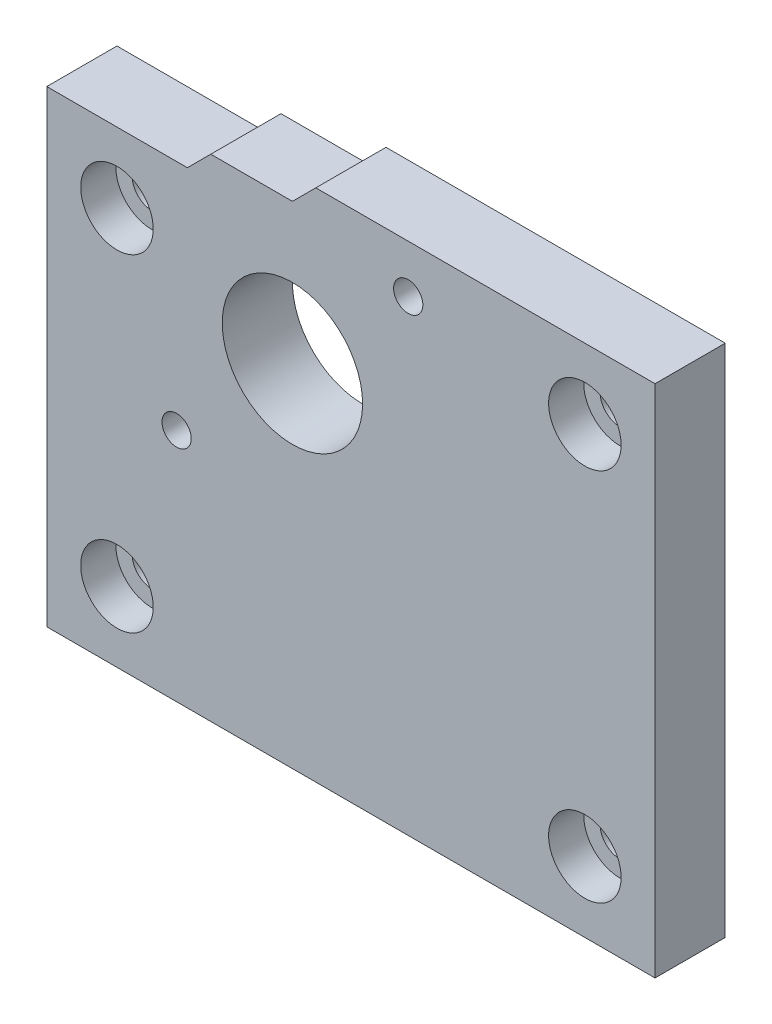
ISO-10303-21;
HEADER;
FILE_DESCRIPTION(('STEP AP214'),'2;1');
FILE_NAME('part.step','',(''),(''),'','','');
FILE_SCHEMA(('AUTOMOTIVE_DESIGN { 1 0 10303 214 1 1 1 1 }'));
ENDSEC;
DATA;
#1=APPLICATION_CONTEXT('core data for automotive mechanical design processes');
#2=APPLICATION_PROTOCOL_DEFINITION('international standard','automotive_design',2000,#1);
#3=PRODUCT_CONTEXT('',#1,'mechanical');
#4=PRODUCT('Part','Part','',(#3));
#5=PRODUCT_RELATED_PRODUCT_CATEGORY('part','',(#4));
#6=PRODUCT_DEFINITION_FORMATION('','',#4);
#7=PRODUCT_DEFINITION_CONTEXT('part definition',#1,'design');
#8=PRODUCT_DEFINITION('design','',#6,#7);
#9=PRODUCT_DEFINITION_SHAPE('','',#8);
#10=(LENGTH_UNIT() NAMED_UNIT(*) SI_UNIT(.MILLI.,.METRE.));
#11=(NAMED_UNIT(*) PLANE_ANGLE_UNIT() SI_UNIT($,.RADIAN.));
#12=(NAMED_UNIT(*) SI_UNIT($,.STERADIAN.) SOLID_ANGLE_UNIT());
#13=UNCERTAINTY_MEASURE_WITH_UNIT(LENGTH_MEASURE(1.E-05),#10,'distance_accuracy_value','');
#14=(GEOMETRIC_REPRESENTATION_CONTEXT(3) GLOBAL_UNCERTAINTY_ASSIGNED_CONTEXT((#13)) GLOBAL_UNIT_ASSIGNED_CONTEXT((#10,
#11,#12)) REPRESENTATION_CONTEXT('',''));
#15=CARTESIAN_POINT('',(0.,0.,0.));
#16=DIRECTION('',(0.,0.,1.));
#17=DIRECTION('',(1.,0.,0.));
#18=AXIS2_PLACEMENT_3D('',#15,#16,#17);
#19=CARTESIAN_POINT('',(-41.6094189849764,34.1564907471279,6.));
#20=DIRECTION('',(0.,0.,-1.));
#21=DIRECTION('',(-1.,0.,0.));
#22=AXIS2_PLACEMENT_3D('',#19,#20,#21);
#23=PLANE('',#22);
#24=CARTESIAN_POINT('',(-30.5089139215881,10.2569958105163,6.));
#25=DIRECTION('',(0.,0.,1.));
#26=DIRECTION('',(1.,0.,0.));
#27=AXIS2_PLACEMENT_3D('',#24,#25,#26);
#28=CIRCLE('',#27,1.25);
#29=CARTESIAN_POINT('',(-29.2589139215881,10.2569958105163,6.));
#30=VERTEX_POINT('',#29);
#31=EDGE_CURVE('E592',#30,#30,#28,.T.);
#32=ORIENTED_EDGE('',*,*,#31,.F.);
#33=EDGE_LOOP('',(#32));
#34=FACE_BOUND('',#33,.T.);
#35=CARTESIAN_POINT('',(-20.6094189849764,20.156490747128,6.));
#36=DIRECTION('',(0.,0.,1.));
#37=DIRECTION('',(1.,0.,0.));
#38=AXIS2_PLACEMENT_3D('',#35,#36,#37);
#39=CIRCLE('',#38,6.);
#40=CARTESIAN_POINT('',(-14.6094189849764,20.156490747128,6.));
#41=VERTEX_POINT('',#40);
#42=EDGE_CURVE('E519',#41,#41,#39,.T.);
#43=ORIENTED_EDGE('',*,*,#42,.F.);
#44=EDGE_LOOP('',(#43));
#45=FACE_BOUND('',#44,.T.);
#46=CARTESIAN_POINT('',(-35.6094189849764,24.156490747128,6.));
#47=DIRECTION('',(0.,0.,1.));
#48=DIRECTION('',(1.,0.,0.));
#49=AXIS2_PLACEMENT_3D('',#46,#47,#48);
#50=CIRCLE('',#49,3.1);
#51=CARTESIAN_POINT('',(-32.5094189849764,24.156490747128,6.));
#52=VERTEX_POINT('',#51);
#53=EDGE_CURVE('E531',#52,#52,#50,.T.);
#54=ORIENTED_EDGE('',*,*,#53,.F.);
#55=EDGE_LOOP('',(#54));
#56=FACE_BOUND('',#55,.T.);
#57=CARTESIAN_POINT('',(-35.6094189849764,-3.84350925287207,6.));
#58=DIRECTION('',(0.,0.,1.));
#59=DIRECTION('',(1.,0.,0.));
#60=AXIS2_PLACEMENT_3D('',#57,#58,#59);
#61=CIRCLE('',#60,3.1);
#62=CARTESIAN_POINT('',(-32.5094189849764,-3.84350925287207,6.));
#63=VERTEX_POINT('',#62);
#64=EDGE_CURVE('E543',#63,#63,#61,.T.);
#65=ORIENTED_EDGE('',*,*,#64,.F.);
#66=EDGE_LOOP('',(#65));
#67=FACE_BOUND('',#66,.T.);
#68=DIRECTION('',(1.,0.,0.));
#69=VECTOR('',#68,1.);
#70=CARTESIAN_POINT('',(-20.6094189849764,32.1564907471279,6.));
#71=LINE('',#70,#69);
#72=CARTESIAN_POINT('',(-27.5894189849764,32.1564907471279,6.));
#73=VERTEX_POINT('',#72);
#74=CARTESIAN_POINT('',(-20.6094189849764,32.1564907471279,6.));
#75=VERTEX_POINT('',#74);
#76=EDGE_CURVE('E157',#73,#75,#71,.T.);
#77=ORIENTED_EDGE('',*,*,#76,.F.);
#78=DIRECTION('',(-0.707106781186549,-0.707106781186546,0.));
#79=VECTOR('',#78,1.);
#80=CARTESIAN_POINT('',(-29.5894189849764,30.156490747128,6.));
#81=LINE('',#80,#79);
#82=CARTESIAN_POINT('',(-29.5894189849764,30.156490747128,6.));
#83=VERTEX_POINT('',#82);
#84=EDGE_CURVE('E11',#73,#83,#81,.T.);
#85=ORIENTED_EDGE('',*,*,#84,.T.);
#86=DIRECTION('',(-1.,0.,0.));
#87=VECTOR('',#86,1.);
#88=CARTESIAN_POINT('',(-41.6094189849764,30.156490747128,6.));
#89=LINE('',#88,#87);
#90=CARTESIAN_POINT('',(-41.6094189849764,30.156490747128,6.));
#91=VERTEX_POINT('',#90);
#92=EDGE_CURVE('E164',#83,#91,#89,.T.);
#93=ORIENTED_EDGE('',*,*,#92,.T.);
#94=DIRECTION('',(0.,-1.,0.));
#95=VECTOR('',#94,1.);
#96=CARTESIAN_POINT('',(-41.6094189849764,-9.84350925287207,6.));
#97=LINE('',#96,#95);
#98=CARTESIAN_POINT('',(-41.6094189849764,-9.84350925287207,6.));
#99=VERTEX_POINT('',#98);
#100=EDGE_CURVE('E167',#91,#99,#97,.T.);
#101=ORIENTED_EDGE('',*,*,#100,.T.);
#102=DIRECTION('',(1.,0.,0.));
#103=VECTOR('',#102,1.);
#104=CARTESIAN_POINT('',(-41.6094189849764,-9.84350925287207,6.));
#105=LINE('',#104,#103);
#106=CARTESIAN_POINT('',(10.3905810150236,-9.84350925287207,6.));
#107=VERTEX_POINT('',#106);
#108=EDGE_CURVE('E169',#99,#107,#105,.T.);
#109=ORIENTED_EDGE('',*,*,#108,.T.);
#110=DIRECTION('',(0.,1.,0.));
#111=VECTOR('',#110,1.);
#112=CARTESIAN_POINT('',(10.3905810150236,-9.84350925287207,6.));
#113=LINE('',#112,#111);
#114=CARTESIAN_POINT('',(10.3905810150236,34.1564907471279,6.));
#115=VERTEX_POINT('',#114);
#116=EDGE_CURVE('E172',#107,#115,#113,.T.);
#117=ORIENTED_EDGE('',*,*,#116,.T.);
#118=DIRECTION('',(-1.,0.,0.));
#119=VECTOR('',#118,1.);
#120=CARTESIAN_POINT('',(-41.6094189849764,34.1564907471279,6.));
#121=LINE('',#120,#119);
#122=CARTESIAN_POINT('',(-18.6094189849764,34.1564907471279,6.));
#123=VERTEX_POINT('',#122);
#124=EDGE_CURVE('E174',#115,#123,#121,.T.);
#125=ORIENTED_EDGE('',*,*,#124,.T.);
#126=DIRECTION('',(0.707106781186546,0.707106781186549,0.));
#127=VECTOR('',#126,1.);
#128=CARTESIAN_POINT('',(-18.6094189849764,34.1564907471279,6.));
#129=LINE('',#128,#127);
#130=EDGE_CURVE('E196',#123,#75,#129,.F.);
#131=ORIENTED_EDGE('',*,*,#130,.T.);
#132=EDGE_LOOP('',(#77,#85,#93,#101,#109,#117,#125,#131));
#133=FACE_BOUND('',#132,.T.);
#134=CARTESIAN_POINT('',(4.3905810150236,-3.84350925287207,6.));
#135=DIRECTION('',(0.,0.,1.));
#136=DIRECTION('',(1.,0.,0.));
#137=AXIS2_PLACEMENT_3D('',#134,#135,#136);
#138=CIRCLE('',#137,3.1);
#139=CARTESIAN_POINT('',(7.4905810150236,-3.84350925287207,6.));
#140=VERTEX_POINT('',#139);
#141=EDGE_CURVE('E498',#140,#140,#138,.T.);
#142=ORIENTED_EDGE('',*,*,#141,.F.);
#143=EDGE_LOOP('',(#142));
#144=FACE_BOUND('',#143,.T.);
#145=CARTESIAN_POINT('',(4.3905810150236,28.156490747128,6.));
#146=DIRECTION('',(0.,0.,1.));
#147=DIRECTION('',(1.,0.,0.));
#148=AXIS2_PLACEMENT_3D('',#145,#146,#147);
#149=CIRCLE('',#148,3.1);
#150=CARTESIAN_POINT('',(7.4905810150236,28.156490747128,6.));
#151=VERTEX_POINT('',#150);
#152=EDGE_CURVE('E555',#151,#151,#149,.T.);
#153=ORIENTED_EDGE('',*,*,#152,.F.);
#154=EDGE_LOOP('',(#153));
#155=FACE_BOUND('',#154,.T.);
#156=CARTESIAN_POINT('',(-10.7099240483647,30.0559856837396,6.));
#157=DIRECTION('',(0.,0.,1.));
#158=DIRECTION('',(1.,0.,0.));
#159=AXIS2_PLACEMENT_3D('',#156,#157,#158);
#160=CIRCLE('',#159,1.25);
#161=CARTESIAN_POINT('',(-9.45992404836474,30.0559856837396,6.));
#162=VERTEX_POINT('',#161);
#163=EDGE_CURVE('E520',#162,#162,#160,.T.);
#164=ORIENTED_EDGE('',*,*,#163,.F.);
#165=EDGE_LOOP('',(#164));
#166=FACE_BOUND('',#165,.T.);
#167=ADVANCED_FACE('F16',(#34,#45,#56,#67,#133,#144,#155,#166),#23,.F.);
#168=CARTESIAN_POINT('',(-41.6094189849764,34.1564907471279,0.));
#169=DIRECTION('',(0.,0.,-1.));
#170=DIRECTION('',(-1.,0.,0.));
#171=AXIS2_PLACEMENT_3D('',#168,#169,#170);
#172=PLANE('',#171);
#173=CARTESIAN_POINT('',(-20.6094189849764,20.156490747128,0.));
#174=DIRECTION('',(0.,0.,1.));
#175=DIRECTION('',(1.,0.,0.));
#176=AXIS2_PLACEMENT_3D('',#173,#174,#175);
#177=CIRCLE('',#176,6.);
#178=CARTESIAN_POINT('',(-14.6094189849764,20.156490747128,0.));
#179=VERTEX_POINT('',#178);
#180=EDGE_CURVE('E523',#179,#179,#177,.T.);
#181=ORIENTED_EDGE('',*,*,#180,.T.);
#182=EDGE_LOOP('',(#181));
#183=FACE_BOUND('',#182,.T.);
#184=CARTESIAN_POINT('',(-35.6094189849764,24.156490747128,0.));
#185=DIRECTION('',(0.,0.,1.));
#186=DIRECTION('',(1.,0.,0.));
#187=AXIS2_PLACEMENT_3D('',#184,#185,#186);
#188=CIRCLE('',#187,1.7);
#189=CARTESIAN_POINT('',(-33.9094189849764,24.156490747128,0.));
#190=VERTEX_POINT('',#189);
#191=EDGE_CURVE('E540',#190,#190,#188,.T.);
#192=ORIENTED_EDGE('',*,*,#191,.T.);
#193=EDGE_LOOP('',(#192));
#194=FACE_BOUND('',#193,.T.);
#195=CARTESIAN_POINT('',(-35.6094189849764,-3.84350925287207,0.));
#196=DIRECTION('',(0.,0.,1.));
#197=DIRECTION('',(1.,0.,0.));
#198=AXIS2_PLACEMENT_3D('',#195,#196,#197);
#199=CIRCLE('',#198,1.7);
#200=CARTESIAN_POINT('',(-33.9094189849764,-3.84350925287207,0.));
#201=VERTEX_POINT('',#200);
#202=EDGE_CURVE('E552',#201,#201,#199,.T.);
#203=ORIENTED_EDGE('',*,*,#202,.T.);
#204=EDGE_LOOP('',(#203));
#205=FACE_BOUND('',#204,.T.);
#206=DIRECTION('',(-1.,0.,0.));
#207=VECTOR('',#206,1.);
#208=CARTESIAN_POINT('',(-41.6094189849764,30.156490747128,0.));
#209=LINE('',#208,#207);
#210=CARTESIAN_POINT('',(-29.5894189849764,30.156490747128,0.));
#211=VERTEX_POINT('',#210);
#212=CARTESIAN_POINT('',(-41.6094189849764,30.156490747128,0.));
#213=VERTEX_POINT('',#212);
#214=EDGE_CURVE('E159',#211,#213,#209,.T.);
#215=ORIENTED_EDGE('',*,*,#214,.F.);
#216=DIRECTION('',(0.707106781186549,0.707106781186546,0.));
#217=VECTOR('',#216,1.);
#218=CARTESIAN_POINT('',(-33.5994189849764,26.146490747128,0.));
#219=LINE('',#218,#217);
#220=CARTESIAN_POINT('',(-27.5894189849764,32.1564907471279,0.));
#221=VERTEX_POINT('',#220);
#222=EDGE_CURVE('E39',#211,#221,#219,.T.);
#223=ORIENTED_EDGE('',*,*,#222,.T.);
#224=DIRECTION('',(-1.,0.,0.));
#225=VECTOR('',#224,1.);
#226=CARTESIAN_POINT('',(-20.6094189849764,32.1564907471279,0.));
#227=LINE('',#226,#225);
#228=CARTESIAN_POINT('',(-20.6094189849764,32.1564907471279,0.));
#229=VERTEX_POINT('',#228);
#230=EDGE_CURVE('E155',#229,#221,#227,.T.);
#231=ORIENTED_EDGE('',*,*,#230,.F.);
#232=DIRECTION('',(-0.707106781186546,-0.707106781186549,0.));
#233=VECTOR('',#232,1.);
#234=CARTESIAN_POINT('',(-30.1094189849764,22.656490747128,0.));
#235=LINE('',#234,#233);
#236=CARTESIAN_POINT('',(-18.6094189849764,34.1564907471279,0.));
#237=VERTEX_POINT('',#236);
#238=EDGE_CURVE('E199',#229,#237,#235,.F.);
#239=ORIENTED_EDGE('',*,*,#238,.T.);
#240=DIRECTION('',(-1.,0.,0.));
#241=VECTOR('',#240,1.);
#242=CARTESIAN_POINT('',(-41.6094189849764,34.1564907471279,0.));
#243=LINE('',#242,#241);
#244=CARTESIAN_POINT('',(10.3905810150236,34.1564907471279,0.));
#245=VERTEX_POINT('',#244);
#246=EDGE_CURVE('E170',#245,#237,#243,.T.);
#247=ORIENTED_EDGE('',*,*,#246,.F.);
#248=DIRECTION('',(0.,1.,0.));
#249=VECTOR('',#248,1.);
#250=CARTESIAN_POINT('',(10.3905810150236,-9.84350925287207,0.));
#251=LINE('',#250,#249);
#252=CARTESIAN_POINT('',(10.3905810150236,-9.84350925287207,0.));
#253=VERTEX_POINT('',#252);
#254=EDGE_CURVE('E181',#253,#245,#251,.T.);
#255=ORIENTED_EDGE('',*,*,#254,.F.);
#256=DIRECTION('',(1.,0.,0.));
#257=VECTOR('',#256,1.);
#258=CARTESIAN_POINT('',(-41.6094189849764,-9.84350925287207,0.));
#259=LINE('',#258,#257);
#260=CARTESIAN_POINT('',(-41.6094189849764,-9.84350925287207,0.));
#261=VERTEX_POINT('',#260);
#262=EDGE_CURVE('E179',#261,#253,#259,.T.);
#263=ORIENTED_EDGE('',*,*,#262,.F.);
#264=DIRECTION('',(0.,-1.,0.));
#265=VECTOR('',#264,1.);
#266=CARTESIAN_POINT('',(-41.6094189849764,-9.84350925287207,0.));
#267=LINE('',#266,#265);
#268=EDGE_CURVE('E166',#213,#261,#267,.T.);
#269=ORIENTED_EDGE('',*,*,#268,.F.);
#270=EDGE_LOOP('',(#215,#223,#231,#239,#247,#255,#263,#269));
#271=FACE_BOUND('',#270,.T.);
#272=CARTESIAN_POINT('',(-33.1894189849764,10.1564907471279,0.));
#273=DIRECTION('',(0.,0.,-1.));
#274=DIRECTION('',(-1.,0.,0.));
#275=AXIS2_PLACEMENT_3D('',#272,#273,#274);
#276=CIRCLE('',#275,2.);
#277=CARTESIAN_POINT('',(-33.1894189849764,8.15649074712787,0.));
#278=VERTEX_POINT('',#277);
#279=CARTESIAN_POINT('',(-33.1894189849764,12.1564907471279,0.));
#280=VERTEX_POINT('',#279);
#281=EDGE_CURVE('E111',#278,#280,#276,.T.);
#282=ORIENTED_EDGE('',*,*,#281,.F.);
#283=DIRECTION('',(-1.,0.,0.));
#284=VECTOR('',#283,1.);
#285=CARTESIAN_POINT('',(-33.1894189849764,8.15649074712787,0.));
#286=LINE('',#285,#284);
#287=CARTESIAN_POINT('',(-8.0094189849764,8.15649074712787,0.));
#288=VERTEX_POINT('',#287);
#289=EDGE_CURVE('E128',#288,#278,#286,.T.);
#290=ORIENTED_EDGE('',*,*,#289,.F.);
#291=CARTESIAN_POINT('',(-8.0094189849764,10.1564907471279,0.));
#292=DIRECTION('',(0.,0.,-1.));
#293=DIRECTION('',(-1.,0.,0.));
#294=AXIS2_PLACEMENT_3D('',#291,#292,#293);
#295=CIRCLE('',#294,2.);
#296=CARTESIAN_POINT('',(-8.0094189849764,12.1564907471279,0.));
#297=VERTEX_POINT('',#296);
#298=EDGE_CURVE('E131',#297,#288,#295,.T.);
#299=ORIENTED_EDGE('',*,*,#298,.F.);
#300=DIRECTION('',(1.,0.,0.));
#301=VECTOR('',#300,1.);
#302=CARTESIAN_POINT('',(-8.0094189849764,12.1564907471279,0.));
#303=LINE('',#302,#301);
#304=EDGE_CURVE('E140',#280,#297,#303,.T.);
#305=ORIENTED_EDGE('',*,*,#304,.F.);
#306=EDGE_LOOP('',(#282,#290,#299,#305));
#307=FACE_BOUND('',#306,.T.);
#308=CARTESIAN_POINT('',(4.3905810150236,-3.84350925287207,0.));
#309=DIRECTION('',(0.,0.,1.));
#310=DIRECTION('',(1.,0.,0.));
#311=AXIS2_PLACEMENT_3D('',#308,#309,#310);
#312=CIRCLE('',#311,1.7);
#313=CARTESIAN_POINT('',(6.0905810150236,-3.84350925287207,0.));
#314=VERTEX_POINT('',#313);
#315=EDGE_CURVE('E134',#314,#314,#312,.T.);
#316=ORIENTED_EDGE('',*,*,#315,.T.);
#317=EDGE_LOOP('',(#316));
#318=FACE_BOUND('',#317,.T.);
#319=CARTESIAN_POINT('',(4.3905810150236,28.156490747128,0.));
#320=DIRECTION('',(0.,0.,1.));
#321=DIRECTION('',(1.,0.,0.));
#322=AXIS2_PLACEMENT_3D('',#319,#320,#321);
#323=CIRCLE('',#322,1.7);
#324=CARTESIAN_POINT('',(6.0905810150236,28.156490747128,0.));
#325=VERTEX_POINT('',#324);
#326=EDGE_CURVE('E499',#325,#325,#323,.T.);
#327=ORIENTED_EDGE('',*,*,#326,.T.);
#328=EDGE_LOOP('',(#327));
#329=FACE_BOUND('',#328,.T.);
#330=CARTESIAN_POINT('',(-10.7099240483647,30.0559856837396,0.));
#331=DIRECTION('',(0.,0.,1.));
#332=DIRECTION('',(1.,0.,0.));
#333=AXIS2_PLACEMENT_3D('',#330,#331,#332);
#334=CIRCLE('',#333,1.25);
#335=CARTESIAN_POINT('',(-9.45992404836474,30.0559856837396,0.));
#336=VERTEX_POINT('',#335);
#337=EDGE_CURVE('E518',#336,#336,#334,.T.);
#338=ORIENTED_EDGE('',*,*,#337,.T.);
#339=EDGE_LOOP('',(#338));
#340=FACE_BOUND('',#339,.T.);
#341=ADVANCED_FACE('F204',(#183,#194,#205,#271,#307,#318,#329,#340),#172,.T.);
#342=CARTESIAN_POINT('',(-41.6094189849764,30.156490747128,8.));
#343=DIRECTION('',(0.,-1.,0.));
#344=DIRECTION('',(0.,0.,-1.));
#345=AXIS2_PLACEMENT_3D('',#342,#343,#344);
#346=PLANE('',#345);
#347=ORIENTED_EDGE('',*,*,#92,.F.);
#348=DIRECTION('',(0.,0.,-1.));
#349=VECTOR('',#348,1.);
#350=CARTESIAN_POINT('',(-29.5894189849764,30.156490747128,0.));
#351=LINE('',#350,#349);
#352=EDGE_CURVE('E146',#83,#211,#351,.T.);
#353=ORIENTED_EDGE('',*,*,#352,.T.);
#354=ORIENTED_EDGE('',*,*,#214,.T.);
#355=DIRECTION('',(0.,0.,-1.));
#356=VECTOR('',#355,1.);
#357=CARTESIAN_POINT('',(-41.6094189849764,30.156490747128,8.));
#358=LINE('',#357,#356);
#359=EDGE_CURVE('E161',#91,#213,#358,.T.);
#360=ORIENTED_EDGE('',*,*,#359,.F.);
#361=EDGE_LOOP('',(#347,#353,#354,#360));
#362=FACE_BOUND('',#361,.T.);
#363=ADVANCED_FACE('F234',(#362),#346,.F.);
#364=CARTESIAN_POINT('',(-41.6094189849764,-9.84350925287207,6.));
#365=DIRECTION('',(1.,0.,0.));
#366=DIRECTION('',(0.,0.,-1.));
#367=AXIS2_PLACEMENT_3D('',#364,#365,#366);
#368=PLANE('',#367);
#369=ORIENTED_EDGE('',*,*,#100,.F.);
#370=ORIENTED_EDGE('',*,*,#359,.T.);
#371=ORIENTED_EDGE('',*,*,#268,.T.);
#372=DIRECTION('',(0.,0.,-1.));
#373=VECTOR('',#372,1.);
#374=CARTESIAN_POINT('',(-41.6094189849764,-9.84350925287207,6.));
#375=LINE('',#374,#373);
#376=EDGE_CURVE('E190',#99,#261,#375,.T.);
#377=ORIENTED_EDGE('',*,*,#376,.F.);
#378=EDGE_LOOP('',(#369,#370,#371,#377));
#379=FACE_BOUND('',#378,.T.);
#380=ADVANCED_FACE('F230',(#379),#368,.F.);
#381=CARTESIAN_POINT('',(-41.6094189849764,-9.84350925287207,6.));
#382=DIRECTION('',(0.,1.,0.));
#383=DIRECTION('',(0.,0.,1.));
#384=AXIS2_PLACEMENT_3D('',#381,#382,#383);
#385=PLANE('',#384);
#386=ORIENTED_EDGE('',*,*,#262,.T.);
#387=DIRECTION('',(0.,0.,-1.));
#388=VECTOR('',#387,1.);
#389=CARTESIAN_POINT('',(10.3905810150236,-9.84350925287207,6.));
#390=LINE('',#389,#388);
#391=EDGE_CURVE('E187',#107,#253,#390,.T.);
#392=ORIENTED_EDGE('',*,*,#391,.F.);
#393=ORIENTED_EDGE('',*,*,#108,.F.);
#394=ORIENTED_EDGE('',*,*,#376,.T.);
#395=EDGE_LOOP('',(#386,#392,#393,#394));
#396=FACE_BOUND('',#395,.T.);
#397=ADVANCED_FACE('F227',(#396),#385,.F.);
#398=CARTESIAN_POINT('',(10.3905810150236,-9.84350925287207,6.));
#399=DIRECTION('',(-1.,0.,0.));
#400=DIRECTION('',(0.,0.,1.));
#401=AXIS2_PLACEMENT_3D('',#398,#399,#400);
#402=PLANE('',#401);
#403=ORIENTED_EDGE('',*,*,#254,.T.);
#404=DIRECTION('',(0.,0.,-1.));
#405=VECTOR('',#404,1.);
#406=CARTESIAN_POINT('',(10.3905810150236,34.1564907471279,6.));
#407=LINE('',#406,#405);
#408=EDGE_CURVE('E177',#115,#245,#407,.T.);
#409=ORIENTED_EDGE('',*,*,#408,.F.);
#410=ORIENTED_EDGE('',*,*,#116,.F.);
#411=ORIENTED_EDGE('',*,*,#391,.T.);
#412=EDGE_LOOP('',(#403,#409,#410,#411));
#413=FACE_BOUND('',#412,.T.);
#414=ADVANCED_FACE('F222',(#413),#402,.F.);
#415=CARTESIAN_POINT('',(-41.6094189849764,34.1564907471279,6.));
#416=DIRECTION('',(0.,-1.,0.));
#417=DIRECTION('',(0.,0.,-1.));
#418=AXIS2_PLACEMENT_3D('',#415,#416,#417);
#419=PLANE('',#418);
#420=ORIENTED_EDGE('',*,*,#246,.T.);
#421=DIRECTION('',(0.,0.,1.));
#422=VECTOR('',#421,1.);
#423=CARTESIAN_POINT('',(-18.6094189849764,34.1564907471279,6.));
#424=LINE('',#423,#422);
#425=EDGE_CURVE('E193',#237,#123,#424,.T.);
#426=ORIENTED_EDGE('',*,*,#425,.T.);
#427=ORIENTED_EDGE('',*,*,#124,.F.);
#428=ORIENTED_EDGE('',*,*,#408,.T.);
#429=EDGE_LOOP('',(#420,#426,#427,#428));
#430=FACE_BOUND('',#429,.T.);
#431=ADVANCED_FACE('F211',(#430),#419,.F.);
#432=CARTESIAN_POINT('',(-20.6094189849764,32.1564907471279,0.));
#433=DIRECTION('',(0.,1.,0.));
#434=DIRECTION('',(0.,0.,1.));
#435=AXIS2_PLACEMENT_3D('',#432,#433,#434);
#436=PLANE('',#435);
#437=ORIENTED_EDGE('',*,*,#230,.T.);
#438=DIRECTION('',(0.,0.,1.));
#439=VECTOR('',#438,1.);
#440=CARTESIAN_POINT('',(-27.5894189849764,32.1564907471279,6.));
#441=LINE('',#440,#439);
#442=EDGE_CURVE('E25',#221,#73,#441,.T.);
#443=ORIENTED_EDGE('',*,*,#442,.T.);
#444=ORIENTED_EDGE('',*,*,#76,.T.);
#445=DIRECTION('',(0.,0.,-1.));
#446=VECTOR('',#445,1.);
#447=CARTESIAN_POINT('',(-20.6094189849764,32.1564907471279,6.));
#448=LINE('',#447,#446);
#449=EDGE_CURVE('E152',#75,#229,#448,.T.);
#450=ORIENTED_EDGE('',*,*,#449,.T.);
#451=EDGE_LOOP('',(#437,#443,#444,#450));
#452=FACE_BOUND('',#451,.T.);
#453=ADVANCED_FACE('F264',(#452),#436,.T.);
#454=CARTESIAN_POINT('',(-33.1894189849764,10.1564907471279,3.));
#455=DIRECTION('',(0.,0.,-1.));
#456=DIRECTION('',(-1.,0.,0.));
#457=AXIS2_PLACEMENT_3D('',#454,#455,#456);
#458=CYLINDRICAL_SURFACE('',#457,2.);
#459=ORIENTED_EDGE('',*,*,#281,.T.);
#460=DIRECTION('',(0.,0.,-1.));
#461=VECTOR('',#460,1.);
#462=CARTESIAN_POINT('',(-33.1894189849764,12.1564907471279,3.));
#463=LINE('',#462,#461);
#464=CARTESIAN_POINT('',(-33.1894189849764,12.1564907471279,3.));
#465=VERTEX_POINT('',#464);
#466=EDGE_CURVE('E104',#465,#280,#463,.T.);
#467=ORIENTED_EDGE('',*,*,#466,.F.);
#468=CARTESIAN_POINT('',(-33.1894189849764,10.1564907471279,3.));
#469=DIRECTION('',(0.,0.,-1.));
#470=DIRECTION('',(-1.,0.,0.));
#471=AXIS2_PLACEMENT_3D('',#468,#469,#470);
#472=CIRCLE('',#471,2.);
#473=CARTESIAN_POINT('',(-33.1894189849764,8.15649074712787,3.));
#474=VERTEX_POINT('',#473);
#475=EDGE_CURVE('E108',#474,#465,#472,.T.);
#476=ORIENTED_EDGE('',*,*,#475,.F.);
#477=DIRECTION('',(0.,0.,-1.));
#478=VECTOR('',#477,1.);
#479=CARTESIAN_POINT('',(-33.1894189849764,8.15649074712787,3.));
#480=LINE('',#479,#478);
#481=EDGE_CURVE('E144',#474,#278,#480,.T.);
#482=ORIENTED_EDGE('',*,*,#481,.T.);
#483=EDGE_LOOP('',(#459,#467,#476,#482));
#484=FACE_BOUND('',#483,.T.);
#485=ADVANCED_FACE('F106',(#484),#458,.F.);
#486=CARTESIAN_POINT('',(-33.1894189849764,8.15649074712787,3.));
#487=DIRECTION('',(0.,-1.,0.));
#488=DIRECTION('',(0.,0.,-1.));
#489=AXIS2_PLACEMENT_3D('',#486,#487,#488);
#490=PLANE('',#489);
#491=ORIENTED_EDGE('',*,*,#289,.T.);
#492=ORIENTED_EDGE('',*,*,#481,.F.);
#493=DIRECTION('',(-1.,0.,0.));
#494=VECTOR('',#493,1.);
#495=CARTESIAN_POINT('',(-33.1894189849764,8.15649074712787,3.));
#496=LINE('',#495,#494);
#497=CARTESIAN_POINT('',(-8.0094189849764,8.15649074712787,3.));
#498=VERTEX_POINT('',#497);
#499=EDGE_CURVE('E116',#498,#474,#496,.T.);
#500=ORIENTED_EDGE('',*,*,#499,.F.);
#501=DIRECTION('',(0.,0.,-1.));
#502=VECTOR('',#501,1.);
#503=CARTESIAN_POINT('',(-8.0094189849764,8.15649074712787,3.));
#504=LINE('',#503,#502);
#505=EDGE_CURVE('E147',#498,#288,#504,.T.);
#506=ORIENTED_EDGE('',*,*,#505,.T.);
#507=EDGE_LOOP('',(#491,#492,#500,#506));
#508=FACE_BOUND('',#507,.T.);
#509=ADVANCED_FACE('F412',(#508),#490,.F.);
#510=CARTESIAN_POINT('',(-8.0094189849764,10.1564907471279,3.));
#511=DIRECTION('',(0.,0.,-1.));
#512=DIRECTION('',(-1.,0.,0.));
#513=AXIS2_PLACEMENT_3D('',#510,#511,#512);
#514=CYLINDRICAL_SURFACE('',#513,2.);
#515=ORIENTED_EDGE('',*,*,#298,.T.);
#516=ORIENTED_EDGE('',*,*,#505,.F.);
#517=CARTESIAN_POINT('',(-8.0094189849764,10.1564907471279,3.));
#518=DIRECTION('',(0.,0.,-1.));
#519=DIRECTION('',(-1.,0.,0.));
#520=AXIS2_PLACEMENT_3D('',#517,#518,#519);
#521=CIRCLE('',#520,2.);
#522=CARTESIAN_POINT('',(-8.0094189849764,12.1564907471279,3.));
#523=VERTEX_POINT('',#522);
#524=EDGE_CURVE('E124',#523,#498,#521,.T.);
#525=ORIENTED_EDGE('',*,*,#524,.F.);
#526=DIRECTION('',(0.,0.,-1.));
#527=VECTOR('',#526,1.);
#528=CARTESIAN_POINT('',(-8.0094189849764,12.1564907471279,3.));
#529=LINE('',#528,#527);
#530=EDGE_CURVE('E115',#523,#297,#529,.T.);
#531=ORIENTED_EDGE('',*,*,#530,.T.);
#532=EDGE_LOOP('',(#515,#516,#525,#531));
#533=FACE_BOUND('',#532,.T.);
#534=ADVANCED_FACE('F417',(#533),#514,.F.);
#535=CARTESIAN_POINT('',(-8.0094189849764,12.1564907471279,3.));
#536=DIRECTION('',(0.,1.,0.));
#537=DIRECTION('',(0.,0.,1.));
#538=AXIS2_PLACEMENT_3D('',#535,#536,#537);
#539=PLANE('',#538);
#540=ORIENTED_EDGE('',*,*,#304,.T.);
#541=ORIENTED_EDGE('',*,*,#530,.F.);
#542=DIRECTION('',(1.,0.,0.));
#543=VECTOR('',#542,1.);
#544=CARTESIAN_POINT('',(-8.0094189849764,12.1564907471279,3.));
#545=LINE('',#544,#543);
#546=EDGE_CURVE('E119',#465,#523,#545,.T.);
#547=ORIENTED_EDGE('',*,*,#546,.F.);
#548=ORIENTED_EDGE('',*,*,#466,.T.);
#549=EDGE_LOOP('',(#540,#541,#547,#548));
#550=FACE_BOUND('',#549,.T.);
#551=ADVANCED_FACE('F120',(#550),#539,.F.);
#552=CARTESIAN_POINT('',(-33.1894189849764,10.1564907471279,3.));
#553=DIRECTION('',(0.,0.,-1.));
#554=DIRECTION('',(-1.,0.,0.));
#555=AXIS2_PLACEMENT_3D('',#552,#553,#554);
#556=PLANE('',#555);
#557=CARTESIAN_POINT('',(-30.5089139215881,10.2569958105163,3.));
#558=DIRECTION('',(0.,0.,-1.));
#559=DIRECTION('',(-1.,0.,0.));
#560=AXIS2_PLACEMENT_3D('',#557,#558,#559);
#561=CIRCLE('',#560,1.25);
#562=CARTESIAN_POINT('',(-31.7589139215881,10.2569958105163,3.));
#563=VERTEX_POINT('',#562);
#564=EDGE_CURVE('E20',#563,#563,#561,.T.);
#565=ORIENTED_EDGE('',*,*,#564,.F.);
#566=EDGE_LOOP('',(#565));
#567=FACE_BOUND('',#566,.T.);
#568=ORIENTED_EDGE('',*,*,#475,.T.);
#569=ORIENTED_EDGE('',*,*,#546,.T.);
#570=ORIENTED_EDGE('',*,*,#524,.T.);
#571=ORIENTED_EDGE('',*,*,#499,.T.);
#572=EDGE_LOOP('',(#568,#569,#570,#571));
#573=FACE_BOUND('',#572,.T.);
#574=ADVANCED_FACE('F126',(#567,#573),#556,.T.);
#575=CARTESIAN_POINT('',(-18.6094189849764,34.1564907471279,6.));
#576=DIRECTION('',(0.707106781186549,-0.707106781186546,0.));
#577=DIRECTION('',(0.707106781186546,0.707106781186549,0.));
#578=AXIS2_PLACEMENT_3D('',#575,#576,#577);
#579=PLANE('',#578);
#580=ORIENTED_EDGE('',*,*,#238,.F.);
#581=ORIENTED_EDGE('',*,*,#449,.F.);
#582=ORIENTED_EDGE('',*,*,#130,.F.);
#583=ORIENTED_EDGE('',*,*,#425,.F.);
#584=EDGE_LOOP('',(#580,#581,#582,#583));
#585=FACE_BOUND('',#584,.T.);
#586=ADVANCED_FACE('F214',(#585),#579,.F.);
#587=CARTESIAN_POINT('',(-29.5894189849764,30.156490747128,0.));
#588=DIRECTION('',(-0.707106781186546,0.707106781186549,0.));
#589=DIRECTION('',(-0.707106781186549,-0.707106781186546,0.));
#590=AXIS2_PLACEMENT_3D('',#587,#588,#589);
#591=PLANE('',#590);
#592=ORIENTED_EDGE('',*,*,#84,.F.);
#593=ORIENTED_EDGE('',*,*,#442,.F.);
#594=ORIENTED_EDGE('',*,*,#222,.F.);
#595=ORIENTED_EDGE('',*,*,#352,.F.);
#596=EDGE_LOOP('',(#592,#593,#594,#595));
#597=FACE_BOUND('',#596,.T.);
#598=ADVANCED_FACE('F18',(#597),#591,.T.);
#599=CARTESIAN_POINT('',(4.3905810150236,-3.84350925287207,6.));
#600=DIRECTION('',(0.,0.,1.));
#601=DIRECTION('',(1.,0.,0.));
#602=AXIS2_PLACEMENT_3D('',#599,#600,#601);
#603=CYLINDRICAL_SURFACE('',#602,1.7);
#604=ORIENTED_EDGE('',*,*,#315,.F.);
#605=EDGE_LOOP('',(#604));
#606=FACE_BOUND('',#605,.T.);
#607=CARTESIAN_POINT('',(4.3905810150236,-3.84350925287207,3.));
#608=DIRECTION('',(0.,0.,1.));
#609=DIRECTION('',(1.,0.,0.));
#610=AXIS2_PLACEMENT_3D('',#607,#608,#609);
#611=CIRCLE('',#610,1.7);
#612=CARTESIAN_POINT('',(6.0905810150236,-3.84350925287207,3.));
#613=VERTEX_POINT('',#612);
#614=EDGE_CURVE('E501',#613,#613,#611,.T.);
#615=ORIENTED_EDGE('',*,*,#614,.T.);
#616=EDGE_LOOP('',(#615));
#617=FACE_BOUND('',#616,.T.);
#618=ADVANCED_FACE('F238',(#606,#617),#603,.F.);
#619=CARTESIAN_POINT('',(6.09058101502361,-3.84350925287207,3.));
#620=DIRECTION('',(0.,0.,-1.));
#621=DIRECTION('',(-1.,0.,0.));
#622=AXIS2_PLACEMENT_3D('',#619,#620,#621);
#623=PLANE('',#622);
#624=ORIENTED_EDGE('',*,*,#614,.F.);
#625=EDGE_LOOP('',(#624));
#626=FACE_BOUND('',#625,.T.);
#627=CARTESIAN_POINT('',(4.3905810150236,-3.84350925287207,3.));
#628=DIRECTION('',(0.,0.,1.));
#629=DIRECTION('',(1.,0.,0.));
#630=AXIS2_PLACEMENT_3D('',#627,#628,#629);
#631=CIRCLE('',#630,3.1);
#632=CARTESIAN_POINT('',(7.4905810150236,-3.84350925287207,3.));
#633=VERTEX_POINT('',#632);
#634=EDGE_CURVE('E495',#633,#633,#631,.T.);
#635=ORIENTED_EDGE('',*,*,#634,.T.);
#636=EDGE_LOOP('',(#635));
#637=FACE_BOUND('',#636,.T.);
#638=ADVANCED_FACE('F245',(#626,#637),#623,.F.);
#639=CARTESIAN_POINT('',(4.3905810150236,-3.84350925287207,6.));
#640=DIRECTION('',(0.,0.,1.));
#641=DIRECTION('',(1.,0.,0.));
#642=AXIS2_PLACEMENT_3D('',#639,#640,#641);
#643=CYLINDRICAL_SURFACE('',#642,3.1);
#644=ORIENTED_EDGE('',*,*,#634,.F.);
#645=EDGE_LOOP('',(#644));
#646=FACE_BOUND('',#645,.T.);
#647=ORIENTED_EDGE('',*,*,#141,.T.);
#648=EDGE_LOOP('',(#647));
#649=FACE_BOUND('',#648,.T.);
#650=ADVANCED_FACE('F298',(#646,#649),#643,.F.);
#651=CARTESIAN_POINT('',(4.3905810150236,28.156490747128,6.));
#652=DIRECTION('',(0.,0.,1.));
#653=DIRECTION('',(1.,0.,0.));
#654=AXIS2_PLACEMENT_3D('',#651,#652,#653);
#655=CYLINDRICAL_SURFACE('',#654,1.7);
#656=ORIENTED_EDGE('',*,*,#326,.F.);
#657=EDGE_LOOP('',(#656));
#658=FACE_BOUND('',#657,.T.);
#659=CARTESIAN_POINT('',(4.3905810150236,28.156490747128,3.));
#660=DIRECTION('',(0.,0.,1.));
#661=DIRECTION('',(1.,0.,0.));
#662=AXIS2_PLACEMENT_3D('',#659,#660,#661);
#663=CIRCLE('',#662,1.7);
#664=CARTESIAN_POINT('',(6.0905810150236,28.156490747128,3.));
#665=VERTEX_POINT('',#664);
#666=EDGE_CURVE('E504',#665,#665,#663,.T.);
#667=ORIENTED_EDGE('',*,*,#666,.T.);
#668=EDGE_LOOP('',(#667));
#669=FACE_BOUND('',#668,.T.);
#670=ADVANCED_FACE('F387',(#658,#669),#655,.F.);
#671=CARTESIAN_POINT('',(6.09058101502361,28.156490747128,3.));
#672=DIRECTION('',(0.,0.,-1.));
#673=DIRECTION('',(-1.,0.,0.));
#674=AXIS2_PLACEMENT_3D('',#671,#672,#673);
#675=PLANE('',#674);
#676=ORIENTED_EDGE('',*,*,#666,.F.);
#677=EDGE_LOOP('',(#676));
#678=FACE_BOUND('',#677,.T.);
#679=CARTESIAN_POINT('',(4.3905810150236,28.156490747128,3.));
#680=DIRECTION('',(0.,0.,1.));
#681=DIRECTION('',(1.,0.,0.));
#682=AXIS2_PLACEMENT_3D('',#679,#680,#681);
#683=CIRCLE('',#682,3.1);
#684=CARTESIAN_POINT('',(7.4905810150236,28.156490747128,3.));
#685=VERTEX_POINT('',#684);
#686=EDGE_CURVE('E558',#685,#685,#683,.T.);
#687=ORIENTED_EDGE('',*,*,#686,.T.);
#688=EDGE_LOOP('',(#687));
#689=FACE_BOUND('',#688,.T.);
#690=ADVANCED_FACE('F379',(#678,#689),#675,.F.);
#691=CARTESIAN_POINT('',(4.3905810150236,28.156490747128,6.));
#692=DIRECTION('',(0.,0.,1.));
#693=DIRECTION('',(1.,0.,0.));
#694=AXIS2_PLACEMENT_3D('',#691,#692,#693);
#695=CYLINDRICAL_SURFACE('',#694,3.1);
#696=ORIENTED_EDGE('',*,*,#686,.F.);
#697=EDGE_LOOP('',(#696));
#698=FACE_BOUND('',#697,.T.);
#699=ORIENTED_EDGE('',*,*,#152,.T.);
#700=EDGE_LOOP('',(#699));
#701=FACE_BOUND('',#700,.T.);
#702=ADVANCED_FACE('F371',(#698,#701),#695,.F.);
#703=CARTESIAN_POINT('',(-35.6094189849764,-3.84350925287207,6.));
#704=DIRECTION('',(0.,0.,1.));
#705=DIRECTION('',(1.,0.,0.));
#706=AXIS2_PLACEMENT_3D('',#703,#704,#705);
#707=CYLINDRICAL_SURFACE('',#706,1.7);
#708=ORIENTED_EDGE('',*,*,#202,.F.);
#709=EDGE_LOOP('',(#708));
#710=FACE_BOUND('',#709,.T.);
#711=CARTESIAN_POINT('',(-35.6094189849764,-3.84350925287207,3.));
#712=DIRECTION('',(0.,0.,1.));
#713=DIRECTION('',(1.,0.,0.));
#714=AXIS2_PLACEMENT_3D('',#711,#712,#713);
#715=CIRCLE('',#714,1.7);
#716=CARTESIAN_POINT('',(-33.9094189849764,-3.84350925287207,3.));
#717=VERTEX_POINT('',#716);
#718=EDGE_CURVE('E549',#717,#717,#715,.T.);
#719=ORIENTED_EDGE('',*,*,#718,.T.);
#720=EDGE_LOOP('',(#719));
#721=FACE_BOUND('',#720,.T.);
#722=ADVANCED_FACE('F363',(#710,#721),#707,.F.);
#723=CARTESIAN_POINT('',(-33.9094189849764,-3.84350925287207,3.));
#724=DIRECTION('',(0.,0.,-1.));
#725=DIRECTION('',(-1.,0.,0.));
#726=AXIS2_PLACEMENT_3D('',#723,#724,#725);
#727=PLANE('',#726);
#728=ORIENTED_EDGE('',*,*,#718,.F.);
#729=EDGE_LOOP('',(#728));
#730=FACE_BOUND('',#729,.T.);
#731=CARTESIAN_POINT('',(-35.6094189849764,-3.84350925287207,3.));
#732=DIRECTION('',(0.,0.,1.));
#733=DIRECTION('',(1.,0.,0.));
#734=AXIS2_PLACEMENT_3D('',#731,#732,#733);
#735=CIRCLE('',#734,3.1);
#736=CARTESIAN_POINT('',(-32.5094189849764,-3.84350925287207,3.));
#737=VERTEX_POINT('',#736);
#738=EDGE_CURVE('E546',#737,#737,#735,.T.);
#739=ORIENTED_EDGE('',*,*,#738,.T.);
#740=EDGE_LOOP('',(#739));
#741=FACE_BOUND('',#740,.T.);
#742=ADVANCED_FACE('F355',(#730,#741),#727,.F.);
#743=CARTESIAN_POINT('',(-35.6094189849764,-3.84350925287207,6.));
#744=DIRECTION('',(0.,0.,1.));
#745=DIRECTION('',(1.,0.,0.));
#746=AXIS2_PLACEMENT_3D('',#743,#744,#745);
#747=CYLINDRICAL_SURFACE('',#746,3.1);
#748=ORIENTED_EDGE('',*,*,#738,.F.);
#749=EDGE_LOOP('',(#748));
#750=FACE_BOUND('',#749,.T.);
#751=ORIENTED_EDGE('',*,*,#64,.T.);
#752=EDGE_LOOP('',(#751));
#753=FACE_BOUND('',#752,.T.);
#754=ADVANCED_FACE('F347',(#750,#753),#747,.F.);
#755=CARTESIAN_POINT('',(-35.6094189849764,24.156490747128,6.));
#756=DIRECTION('',(0.,0.,1.));
#757=DIRECTION('',(1.,0.,0.));
#758=AXIS2_PLACEMENT_3D('',#755,#756,#757);
#759=CYLINDRICAL_SURFACE('',#758,1.7);
#760=ORIENTED_EDGE('',*,*,#191,.F.);
#761=EDGE_LOOP('',(#760));
#762=FACE_BOUND('',#761,.T.);
#763=CARTESIAN_POINT('',(-35.6094189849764,24.156490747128,3.));
#764=DIRECTION('',(0.,0.,1.));
#765=DIRECTION('',(1.,0.,0.));
#766=AXIS2_PLACEMENT_3D('',#763,#764,#765);
#767=CIRCLE('',#766,1.7);
#768=CARTESIAN_POINT('',(-33.9094189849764,24.156490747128,3.));
#769=VERTEX_POINT('',#768);
#770=EDGE_CURVE('E537',#769,#769,#767,.T.);
#771=ORIENTED_EDGE('',*,*,#770,.T.);
#772=EDGE_LOOP('',(#771));
#773=FACE_BOUND('',#772,.T.);
#774=ADVANCED_FACE('F339',(#762,#773),#759,.F.);
#775=CARTESIAN_POINT('',(-33.9094189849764,24.156490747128,3.));
#776=DIRECTION('',(0.,0.,-1.));
#777=DIRECTION('',(-1.,0.,0.));
#778=AXIS2_PLACEMENT_3D('',#775,#776,#777);
#779=PLANE('',#778);
#780=ORIENTED_EDGE('',*,*,#770,.F.);
#781=EDGE_LOOP('',(#780));
#782=FACE_BOUND('',#781,.T.);
#783=CARTESIAN_POINT('',(-35.6094189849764,24.156490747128,3.));
#784=DIRECTION('',(0.,0.,1.));
#785=DIRECTION('',(1.,0.,0.));
#786=AXIS2_PLACEMENT_3D('',#783,#784,#785);
#787=CIRCLE('',#786,3.1);
#788=CARTESIAN_POINT('',(-32.5094189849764,24.156490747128,3.));
#789=VERTEX_POINT('',#788);
#790=EDGE_CURVE('E534',#789,#789,#787,.T.);
#791=ORIENTED_EDGE('',*,*,#790,.T.);
#792=EDGE_LOOP('',(#791));
#793=FACE_BOUND('',#792,.T.);
#794=ADVANCED_FACE('F331',(#782,#793),#779,.F.);
#795=CARTESIAN_POINT('',(-35.6094189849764,24.156490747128,6.));
#796=DIRECTION('',(0.,0.,1.));
#797=DIRECTION('',(1.,0.,0.));
#798=AXIS2_PLACEMENT_3D('',#795,#796,#797);
#799=CYLINDRICAL_SURFACE('',#798,3.1);
#800=ORIENTED_EDGE('',*,*,#790,.F.);
#801=EDGE_LOOP('',(#800));
#802=FACE_BOUND('',#801,.T.);
#803=ORIENTED_EDGE('',*,*,#53,.T.);
#804=EDGE_LOOP('',(#803));
#805=FACE_BOUND('',#804,.T.);
#806=ADVANCED_FACE('F323',(#802,#805),#799,.F.);
#807=CARTESIAN_POINT('',(-20.6094189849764,20.156490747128,6.));
#808=DIRECTION('',(0.,0.,1.));
#809=DIRECTION('',(1.,0.,0.));
#810=AXIS2_PLACEMENT_3D('',#807,#808,#809);
#811=CYLINDRICAL_SURFACE('',#810,6.);
#812=ORIENTED_EDGE('',*,*,#180,.F.);
#813=EDGE_LOOP('',(#812));
#814=FACE_BOUND('',#813,.T.);
#815=ORIENTED_EDGE('',*,*,#42,.T.);
#816=EDGE_LOOP('',(#815));
#817=FACE_BOUND('',#816,.T.);
#818=ADVANCED_FACE('F308',(#814,#817),#811,.F.);
#819=CARTESIAN_POINT('',(-10.7099240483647,30.0559856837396,6.));
#820=DIRECTION('',(0.,0.,1.));
#821=DIRECTION('',(1.,0.,0.));
#822=AXIS2_PLACEMENT_3D('',#819,#820,#821);
#823=CYLINDRICAL_SURFACE('',#822,1.25);
#824=ORIENTED_EDGE('',*,*,#337,.F.);
#825=EDGE_LOOP('',(#824));
#826=FACE_BOUND('',#825,.T.);
#827=ORIENTED_EDGE('',*,*,#163,.T.);
#828=EDGE_LOOP('',(#827));
#829=FACE_BOUND('',#828,.T.);
#830=ADVANCED_FACE('F302',(#826,#829),#823,.F.);
#831=CARTESIAN_POINT('',(-30.5089139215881,10.2569958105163,6.));
#832=DIRECTION('',(0.,0.,1.));
#833=DIRECTION('',(1.,0.,0.));
#834=AXIS2_PLACEMENT_3D('',#831,#832,#833);
#835=CYLINDRICAL_SURFACE('',#834,1.25);
#836=ORIENTED_EDGE('',*,*,#564,.T.);
#837=EDGE_LOOP('',(#836));
#838=FACE_BOUND('',#837,.T.);
#839=ORIENTED_EDGE('',*,*,#31,.T.);
#840=EDGE_LOOP('',(#839));
#841=FACE_BOUND('',#840,.T.);
#842=ADVANCED_FACE('F307',(#838,#841),#835,.F.);
#843=CLOSED_SHELL('',(#167,#341,#363,#380,#397,#414,#431,#453,#485,#509,#534,#551,#574,#586,
#598,#618,#638,#650,#670,#690,#702,#722,#742,#754,#774,#794,#806,#818,#830,#842));
#844=MANIFOLD_SOLID_BREP('B1',#843);
#845=ADVANCED_BREP_SHAPE_REPRESENTATION('',(#18,#844),#14);
#846=SHAPE_DEFINITION_REPRESENTATION(#9,#845);
ENDSEC;
END-ISO-10303-21;
